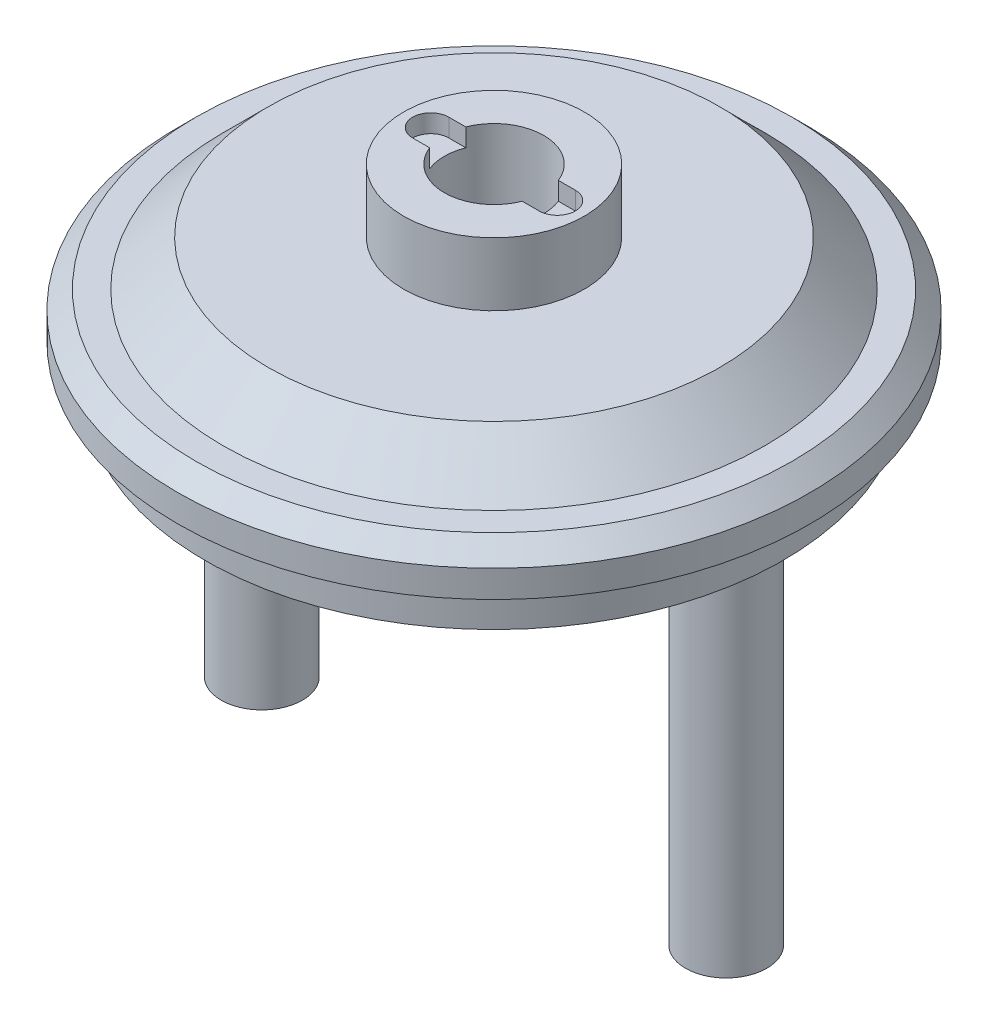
ISO-10303-21;
HEADER;
FILE_DESCRIPTION(('STEP AP214'),'2;1');
FILE_NAME('part.step','',(''),(''),'','','');
FILE_SCHEMA(('AUTOMOTIVE_DESIGN { 1 0 10303 214 1 1 1 1 }'));
ENDSEC;
DATA;
#1=APPLICATION_CONTEXT('core data for automotive mechanical design processes');
#2=APPLICATION_PROTOCOL_DEFINITION('international standard','automotive_design',2000,#1);
#3=PRODUCT_CONTEXT('',#1,'mechanical');
#4=PRODUCT('Part','Part','',(#3));
#5=PRODUCT_RELATED_PRODUCT_CATEGORY('part','',(#4));
#6=PRODUCT_DEFINITION_FORMATION('','',#4);
#7=PRODUCT_DEFINITION_CONTEXT('part definition',#1,'design');
#8=PRODUCT_DEFINITION('design','',#6,#7);
#9=PRODUCT_DEFINITION_SHAPE('','',#8);
#10=(LENGTH_UNIT() NAMED_UNIT(*) SI_UNIT(.MILLI.,.METRE.));
#11=(NAMED_UNIT(*) PLANE_ANGLE_UNIT() SI_UNIT($,.RADIAN.));
#12=(NAMED_UNIT(*) SI_UNIT($,.STERADIAN.) SOLID_ANGLE_UNIT());
#13=UNCERTAINTY_MEASURE_WITH_UNIT(LENGTH_MEASURE(1.E-05),#10,'distance_accuracy_value','');
#14=(GEOMETRIC_REPRESENTATION_CONTEXT(3) GLOBAL_UNCERTAINTY_ASSIGNED_CONTEXT((#13)) GLOBAL_UNIT_ASSIGNED_CONTEXT((#10,
#11,#12)) REPRESENTATION_CONTEXT('',''));
#15=CARTESIAN_POINT('',(0.,0.,0.));
#16=DIRECTION('',(0.,0.,1.));
#17=DIRECTION('',(1.,0.,0.));
#18=AXIS2_PLACEMENT_3D('',#15,#16,#17);
#19=CARTESIAN_POINT('',(0.,15.,0.));
#20=DIRECTION('',(0.,1.,0.));
#21=DIRECTION('',(0.,0.,1.));
#22=AXIS2_PLACEMENT_3D('',#19,#20,#21);
#23=PLANE('',#22);
#24=CARTESIAN_POINT('',(0.,15.,0.));
#25=DIRECTION('',(0.,1.,0.));
#26=DIRECTION('',(0.,0.,1.));
#27=AXIS2_PLACEMENT_3D('',#24,#25,#26);
#28=CIRCLE('',#27,25.);
#29=CARTESIAN_POINT('',(0.,15.,25.));
#30=VERTEX_POINT('',#29);
#31=EDGE_CURVE('E191',#30,#30,#28,.T.);
#32=ORIENTED_EDGE('',*,*,#31,.T.);
#33=EDGE_LOOP('',(#32));
#34=FACE_BOUND('',#33,.T.);
#35=CARTESIAN_POINT('',(0.,15.,0.));
#36=DIRECTION('',(0.,1.,0.));
#37=DIRECTION('',(0.,0.,1.));
#38=AXIS2_PLACEMENT_3D('',#35,#36,#37);
#39=CIRCLE('',#38,10.);
#40=CARTESIAN_POINT('',(0.,15.,10.));
#41=VERTEX_POINT('',#40);
#42=EDGE_CURVE('E148',#41,#41,#39,.T.);
#43=ORIENTED_EDGE('',*,*,#42,.F.);
#44=EDGE_LOOP('',(#43));
#45=FACE_BOUND('',#44,.T.);
#46=ADVANCED_FACE('F33',(#34,#45),#23,.T.);
#47=CARTESIAN_POINT('',(0.,15.,0.));
#48=DIRECTION('',(0.,-1.,0.));
#49=DIRECTION('',(0.,0.,-1.));
#50=AXIS2_PLACEMENT_3D('',#47,#48,#49);
#51=CYLINDRICAL_SURFACE('',#50,35.);
#52=CARTESIAN_POINT('',(0.,8.00000000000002,0.));
#53=DIRECTION('',(0.,1.,0.));
#54=DIRECTION('',(0.,0.,1.));
#55=AXIS2_PLACEMENT_3D('',#52,#53,#54);
#56=CIRCLE('',#55,35.);
#57=CARTESIAN_POINT('',(0.,8.00000000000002,35.));
#58=VERTEX_POINT('',#57);
#59=EDGE_CURVE('E11',#58,#58,#56,.F.);
#60=ORIENTED_EDGE('',*,*,#59,.T.);
#61=EDGE_LOOP('',(#60));
#62=FACE_BOUND('',#61,.T.);
#63=CARTESIAN_POINT('',(0.,5.,0.));
#64=DIRECTION('',(0.,-1.,0.));
#65=DIRECTION('',(0.,0.,-1.));
#66=AXIS2_PLACEMENT_3D('',#63,#64,#65);
#67=CIRCLE('',#66,35.);
#68=CARTESIAN_POINT('',(0.,5.,-35.));
#69=VERTEX_POINT('',#68);
#70=EDGE_CURVE('E167',#69,#69,#67,.T.);
#71=ORIENTED_EDGE('',*,*,#70,.F.);
#72=EDGE_LOOP('',(#71));
#73=FACE_BOUND('',#72,.T.);
#74=ADVANCED_FACE('F208',(#62,#73),#51,.T.);
#75=CARTESIAN_POINT('',(0.,0.,0.));
#76=DIRECTION('',(0.,1.,0.));
#77=DIRECTION('',(0.,0.,1.));
#78=AXIS2_PLACEMENT_3D('',#75,#76,#77);
#79=PLANE('',#78);
#80=CARTESIAN_POINT('',(0.,0.,0.));
#81=DIRECTION('',(0.,1.,0.));
#82=DIRECTION('',(0.,0.,1.));
#83=AXIS2_PLACEMENT_3D('',#80,#81,#82);
#84=CIRCLE('',#83,5.5);
#85=CARTESIAN_POINT('',(0.,0.,5.5));
#86=VERTEX_POINT('',#85);
#87=EDGE_CURVE('E145',#86,#86,#84,.T.);
#88=ORIENTED_EDGE('',*,*,#87,.T.);
#89=EDGE_LOOP('',(#88));
#90=FACE_BOUND('',#89,.T.);
#91=CARTESIAN_POINT('',(-25.7,0.,0.));
#92=DIRECTION('',(0.,1.,0.));
#93=DIRECTION('',(0.,0.,1.));
#94=AXIS2_PLACEMENT_3D('',#91,#92,#93);
#95=CIRCLE('',#94,4.5);
#96=CARTESIAN_POINT('',(-25.7,0.,4.5));
#97=VERTEX_POINT('',#96);
#98=EDGE_CURVE('E172',#97,#97,#95,.F.);
#99=ORIENTED_EDGE('',*,*,#98,.F.);
#100=EDGE_LOOP('',(#99));
#101=FACE_BOUND('',#100,.T.);
#102=CARTESIAN_POINT('',(0.,0.,0.));
#103=DIRECTION('',(0.,-1.,0.));
#104=DIRECTION('',(0.,0.,-1.));
#105=AXIS2_PLACEMENT_3D('',#102,#103,#104);
#106=CIRCLE('',#105,32.);
#107=CARTESIAN_POINT('',(0.,0.,-32.));
#108=VERTEX_POINT('',#107);
#109=EDGE_CURVE('E163',#108,#108,#106,.T.);
#110=ORIENTED_EDGE('',*,*,#109,.T.);
#111=EDGE_LOOP('',(#110));
#112=FACE_BOUND('',#111,.T.);
#113=CARTESIAN_POINT('',(25.7,0.,0.));
#114=DIRECTION('',(0.,1.,0.));
#115=DIRECTION('',(0.,0.,1.));
#116=AXIS2_PLACEMENT_3D('',#113,#114,#115);
#117=CIRCLE('',#116,4.5);
#118=CARTESIAN_POINT('',(25.7,0.,4.5));
#119=VERTEX_POINT('',#118);
#120=EDGE_CURVE('E175',#119,#119,#117,.F.);
#121=ORIENTED_EDGE('',*,*,#120,.F.);
#122=EDGE_LOOP('',(#121));
#123=FACE_BOUND('',#122,.T.);
#124=ADVANCED_FACE('F214',(#90,#101,#112,#123),#79,.F.);
#125=CARTESIAN_POINT('',(0.,5.,0.));
#126=DIRECTION('',(0.,-1.,0.));
#127=DIRECTION('',(0.,0.,-1.));
#128=AXIS2_PLACEMENT_3D('',#125,#126,#127);
#129=PLANE('',#128);
#130=CARTESIAN_POINT('',(0.,5.,0.));
#131=DIRECTION('',(0.,-1.,0.));
#132=DIRECTION('',(0.,0.,-1.));
#133=AXIS2_PLACEMENT_3D('',#130,#131,#132);
#134=CIRCLE('',#133,32.);
#135=CARTESIAN_POINT('',(0.,5.,-32.));
#136=VERTEX_POINT('',#135);
#137=EDGE_CURVE('E164',#136,#136,#134,.T.);
#138=ORIENTED_EDGE('',*,*,#137,.F.);
#139=EDGE_LOOP('',(#138));
#140=FACE_BOUND('',#139,.T.);
#141=ORIENTED_EDGE('',*,*,#70,.T.);
#142=EDGE_LOOP('',(#141));
#143=FACE_BOUND('',#142,.T.);
#144=ADVANCED_FACE('F220',(#140,#143),#129,.T.);
#145=CARTESIAN_POINT('',(0.,5.,0.));
#146=DIRECTION('',(0.,-1.,0.));
#147=DIRECTION('',(0.,0.,-1.));
#148=AXIS2_PLACEMENT_3D('',#145,#146,#147);
#149=CYLINDRICAL_SURFACE('',#148,32.);
#150=ORIENTED_EDGE('',*,*,#137,.T.);
#151=EDGE_LOOP('',(#150));
#152=FACE_BOUND('',#151,.T.);
#153=ORIENTED_EDGE('',*,*,#109,.F.);
#154=EDGE_LOOP('',(#153));
#155=FACE_BOUND('',#154,.T.);
#156=ADVANCED_FACE('F227',(#152,#155),#149,.T.);
#157=CARTESIAN_POINT('',(-25.7,-40.,0.));
#158=DIRECTION('',(0.,1.,0.));
#159=DIRECTION('',(0.,0.,1.));
#160=AXIS2_PLACEMENT_3D('',#157,#158,#159);
#161=CYLINDRICAL_SURFACE('',#160,4.5);
#162=CARTESIAN_POINT('',(-25.7,-40.,0.));
#163=DIRECTION('',(0.,-1.,0.));
#164=DIRECTION('',(0.,0.,-1.));
#165=AXIS2_PLACEMENT_3D('',#162,#163,#164);
#166=CIRCLE('',#165,4.5);
#167=CARTESIAN_POINT('',(-25.7,-40.,-4.5));
#168=VERTEX_POINT('',#167);
#169=EDGE_CURVE('E160',#168,#168,#166,.T.);
#170=ORIENTED_EDGE('',*,*,#169,.F.);
#171=EDGE_LOOP('',(#170));
#172=FACE_BOUND('',#171,.T.);
#173=ORIENTED_EDGE('',*,*,#98,.T.);
#174=EDGE_LOOP('',(#173));
#175=FACE_BOUND('',#174,.T.);
#176=ADVANCED_FACE('F249',(#172,#175),#161,.T.);
#177=CARTESIAN_POINT('',(-25.7,-40.,0.));
#178=DIRECTION('',(0.,-1.,0.));
#179=DIRECTION('',(0.,0.,-1.));
#180=AXIS2_PLACEMENT_3D('',#177,#178,#179);
#181=PLANE('',#180);
#182=ORIENTED_EDGE('',*,*,#169,.T.);
#183=EDGE_LOOP('',(#182));
#184=FACE_BOUND('',#183,.T.);
#185=ADVANCED_FACE('F240',(#184),#181,.T.);
#186=CARTESIAN_POINT('',(25.7,-40.,0.));
#187=DIRECTION('',(0.,1.,0.));
#188=DIRECTION('',(0.,0.,1.));
#189=AXIS2_PLACEMENT_3D('',#186,#187,#188);
#190=CYLINDRICAL_SURFACE('',#189,4.5);
#191=CARTESIAN_POINT('',(25.7,-40.,0.));
#192=DIRECTION('',(0.,-1.,0.));
#193=DIRECTION('',(0.,0.,-1.));
#194=AXIS2_PLACEMENT_3D('',#191,#192,#193);
#195=CIRCLE('',#194,4.5);
#196=CARTESIAN_POINT('',(25.7,-40.,-4.5));
#197=VERTEX_POINT('',#196);
#198=EDGE_CURVE('E157',#197,#197,#195,.T.);
#199=ORIENTED_EDGE('',*,*,#198,.F.);
#200=EDGE_LOOP('',(#199));
#201=FACE_BOUND('',#200,.T.);
#202=ORIENTED_EDGE('',*,*,#120,.T.);
#203=EDGE_LOOP('',(#202));
#204=FACE_BOUND('',#203,.T.);
#205=ADVANCED_FACE('F237',(#201,#204),#190,.T.);
#206=CARTESIAN_POINT('',(25.7,-40.,0.));
#207=DIRECTION('',(0.,-1.,0.));
#208=DIRECTION('',(0.,0.,-1.));
#209=AXIS2_PLACEMENT_3D('',#206,#207,#208);
#210=PLANE('',#209);
#211=ORIENTED_EDGE('',*,*,#198,.T.);
#212=EDGE_LOOP('',(#211));
#213=FACE_BOUND('',#212,.T.);
#214=ADVANCED_FACE('F239',(#213),#210,.T.);
#215=CARTESIAN_POINT('',(0.,10.,0.));
#216=DIRECTION('',(0.,1.,0.));
#217=DIRECTION('',(0.,0.,1.));
#218=AXIS2_PLACEMENT_3D('',#215,#216,#217);
#219=PLANE('',#218);
#220=CARTESIAN_POINT('',(0.,10.,0.));
#221=DIRECTION('',(0.,1.,0.));
#222=DIRECTION('',(0.,0.,1.));
#223=AXIS2_PLACEMENT_3D('',#220,#221,#222);
#224=CIRCLE('',#223,33.);
#225=CARTESIAN_POINT('',(0.,10.,33.));
#226=VERTEX_POINT('',#225);
#227=EDGE_CURVE('E41',#226,#226,#224,.T.);
#228=ORIENTED_EDGE('',*,*,#227,.T.);
#229=EDGE_LOOP('',(#228));
#230=FACE_BOUND('',#229,.T.);
#231=CARTESIAN_POINT('',(0.,10.,0.));
#232=DIRECTION('',(0.,1.,0.));
#233=DIRECTION('',(0.,0.,1.));
#234=AXIS2_PLACEMENT_3D('',#231,#232,#233);
#235=CIRCLE('',#234,30.);
#236=CARTESIAN_POINT('',(0.,10.,30.));
#237=VERTEX_POINT('',#236);
#238=EDGE_CURVE('E152',#237,#237,#235,.T.);
#239=ORIENTED_EDGE('',*,*,#238,.F.);
#240=EDGE_LOOP('',(#239));
#241=FACE_BOUND('',#240,.T.);
#242=ADVANCED_FACE('F196',(#230,#241),#219,.T.);
#243=CARTESIAN_POINT('',(0.,22.,0.));
#244=DIRECTION('',(0.,-1.,0.));
#245=DIRECTION('',(0.,0.,-1.));
#246=AXIS2_PLACEMENT_3D('',#243,#244,#245);
#247=CYLINDRICAL_SURFACE('',#246,10.);
#248=CARTESIAN_POINT('',(0.,22.,0.));
#249=DIRECTION('',(0.,1.,0.));
#250=DIRECTION('',(0.,0.,1.));
#251=AXIS2_PLACEMENT_3D('',#248,#249,#250);
#252=CIRCLE('',#251,10.);
#253=CARTESIAN_POINT('',(0.,22.,10.));
#254=VERTEX_POINT('',#253);
#255=EDGE_CURVE('E149',#254,#254,#252,.T.);
#256=ORIENTED_EDGE('',*,*,#255,.F.);
#257=EDGE_LOOP('',(#256));
#258=FACE_BOUND('',#257,.T.);
#259=ORIENTED_EDGE('',*,*,#42,.T.);
#260=EDGE_LOOP('',(#259));
#261=FACE_BOUND('',#260,.T.);
#262=ADVANCED_FACE('F293',(#258,#261),#247,.T.);
#263=CARTESIAN_POINT('',(0.,22.,0.));
#264=DIRECTION('',(0.,1.,0.));
#265=DIRECTION('',(0.,0.,1.));
#266=AXIS2_PLACEMENT_3D('',#263,#264,#265);
#267=PLANE('',#266);
#268=DIRECTION('',(-1.,0.,0.));
#269=VECTOR('',#268,1.);
#270=CARTESIAN_POINT('',(-7.,22.,-2.));
#271=LINE('',#270,#269);
#272=CARTESIAN_POINT('',(-5.1234753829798,22.,-2.));
#273=VERTEX_POINT('',#272);
#274=CARTESIAN_POINT('',(-7.,22.,-2.));
#275=VERTEX_POINT('',#274);
#276=EDGE_CURVE('E123',#273,#275,#271,.T.);
#277=ORIENTED_EDGE('',*,*,#276,.F.);
#278=CARTESIAN_POINT('',(0.,22.,0.));
#279=DIRECTION('',(0.,1.,0.));
#280=DIRECTION('',(0.,0.,1.));
#281=AXIS2_PLACEMENT_3D('',#278,#279,#280);
#282=CIRCLE('',#281,5.5);
#283=CARTESIAN_POINT('',(5.1234753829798,22.,-2.));
#284=VERTEX_POINT('',#283);
#285=EDGE_CURVE('E144',#284,#273,#282,.T.);
#286=ORIENTED_EDGE('',*,*,#285,.F.);
#287=CARTESIAN_POINT('',(7.,22.,-2.));
#288=VERTEX_POINT('',#287);
#289=EDGE_CURVE('E121',#288,#284,#271,.T.);
#290=ORIENTED_EDGE('',*,*,#289,.F.);
#291=CARTESIAN_POINT('',(7.,22.,0.));
#292=DIRECTION('',(0.,1.,0.));
#293=DIRECTION('',(0.,0.,1.));
#294=AXIS2_PLACEMENT_3D('',#291,#292,#293);
#295=CIRCLE('',#294,2.);
#296=CARTESIAN_POINT('',(7.,22.,2.));
#297=VERTEX_POINT('',#296);
#298=EDGE_CURVE('E132',#297,#288,#295,.T.);
#299=ORIENTED_EDGE('',*,*,#298,.F.);
#300=DIRECTION('',(1.,0.,0.));
#301=VECTOR('',#300,1.);
#302=CARTESIAN_POINT('',(-7.,22.,2.));
#303=LINE('',#302,#301);
#304=CARTESIAN_POINT('',(5.1234753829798,22.,2.));
#305=VERTEX_POINT('',#304);
#306=EDGE_CURVE('E129',#305,#297,#303,.T.);
#307=ORIENTED_EDGE('',*,*,#306,.F.);
#308=CARTESIAN_POINT('',(-5.1234753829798,22.,2.));
#309=VERTEX_POINT('',#308);
#310=EDGE_CURVE('E137',#309,#305,#282,.T.);
#311=ORIENTED_EDGE('',*,*,#310,.F.);
#312=CARTESIAN_POINT('',(-7.,22.,2.));
#313=VERTEX_POINT('',#312);
#314=EDGE_CURVE('E130',#313,#309,#303,.T.);
#315=ORIENTED_EDGE('',*,*,#314,.F.);
#316=CARTESIAN_POINT('',(-7.,22.,0.));
#317=DIRECTION('',(0.,1.,0.));
#318=DIRECTION('',(0.,0.,1.));
#319=AXIS2_PLACEMENT_3D('',#316,#317,#318);
#320=CIRCLE('',#319,2.);
#321=EDGE_CURVE('E105',#275,#313,#320,.T.);
#322=ORIENTED_EDGE('',*,*,#321,.F.);
#323=EDGE_LOOP('',(#277,#286,#290,#299,#307,#311,#315,#322));
#324=FACE_BOUND('',#323,.T.);
#325=ORIENTED_EDGE('',*,*,#255,.T.);
#326=EDGE_LOOP('',(#325));
#327=FACE_BOUND('',#326,.T.);
#328=ADVANCED_FACE('F297',(#324,#327),#267,.T.);
#329=CARTESIAN_POINT('',(0.,-8.,0.));
#330=DIRECTION('',(0.,1.,0.));
#331=DIRECTION('',(0.,0.,1.));
#332=AXIS2_PLACEMENT_3D('',#329,#330,#331);
#333=CYLINDRICAL_SURFACE('',#332,5.5);
#334=ORIENTED_EDGE('',*,*,#285,.T.);
#335=DIRECTION('',(0.,1.,0.));
#336=VECTOR('',#335,1.);
#337=CARTESIAN_POINT('',(-5.1234753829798,-8.,-2.));
#338=LINE('',#337,#336);
#339=CARTESIAN_POINT('',(-5.1234753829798,20.,-2.));
#340=VERTEX_POINT('',#339);
#341=EDGE_CURVE('E188',#273,#340,#338,.F.);
#342=ORIENTED_EDGE('',*,*,#341,.T.);
#343=CARTESIAN_POINT('',(0.,20.,0.));
#344=DIRECTION('',(0.,1.,0.));
#345=DIRECTION('',(0.,0.,1.));
#346=AXIS2_PLACEMENT_3D('',#343,#344,#345);
#347=CIRCLE('',#346,5.5);
#348=CARTESIAN_POINT('',(-5.1234753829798,20.,2.));
#349=VERTEX_POINT('',#348);
#350=EDGE_CURVE('E181',#349,#340,#347,.F.);
#351=ORIENTED_EDGE('',*,*,#350,.F.);
#352=DIRECTION('',(0.,1.,0.));
#353=VECTOR('',#352,1.);
#354=CARTESIAN_POINT('',(-5.1234753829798,-8.,2.));
#355=LINE('',#354,#353);
#356=EDGE_CURVE('E112',#349,#309,#355,.T.);
#357=ORIENTED_EDGE('',*,*,#356,.T.);
#358=ORIENTED_EDGE('',*,*,#310,.T.);
#359=DIRECTION('',(0.,1.,0.));
#360=VECTOR('',#359,1.);
#361=CARTESIAN_POINT('',(5.1234753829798,-8.,2.));
#362=LINE('',#361,#360);
#363=CARTESIAN_POINT('',(5.1234753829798,20.,2.));
#364=VERTEX_POINT('',#363);
#365=EDGE_CURVE('E180',#305,#364,#362,.F.);
#366=ORIENTED_EDGE('',*,*,#365,.T.);
#367=CARTESIAN_POINT('',(5.1234753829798,20.,-2.));
#368=VERTEX_POINT('',#367);
#369=EDGE_CURVE('E178',#368,#364,#347,.F.);
#370=ORIENTED_EDGE('',*,*,#369,.F.);
#371=DIRECTION('',(0.,1.,0.));
#372=VECTOR('',#371,1.);
#373=CARTESIAN_POINT('',(5.1234753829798,-8.,-2.));
#374=LINE('',#373,#372);
#375=EDGE_CURVE('E184',#368,#284,#374,.T.);
#376=ORIENTED_EDGE('',*,*,#375,.T.);
#377=EDGE_LOOP('',(#334,#342,#351,#357,#358,#366,#370,#376));
#378=FACE_BOUND('',#377,.T.);
#379=ORIENTED_EDGE('',*,*,#87,.F.);
#380=EDGE_LOOP('',(#379));
#381=FACE_BOUND('',#380,.T.);
#382=ADVANCED_FACE('F313',(#378,#381),#333,.F.);
#383=CARTESIAN_POINT('',(-7.,20.,0.));
#384=DIRECTION('',(0.,1.,0.));
#385=DIRECTION('',(0.,0.,1.));
#386=AXIS2_PLACEMENT_3D('',#383,#384,#385);
#387=PLANE('',#386);
#388=ORIENTED_EDGE('',*,*,#369,.T.);
#389=DIRECTION('',(1.,0.,0.));
#390=VECTOR('',#389,1.);
#391=CARTESIAN_POINT('',(-7.,20.,2.));
#392=LINE('',#391,#390);
#393=CARTESIAN_POINT('',(7.,20.,2.));
#394=VERTEX_POINT('',#393);
#395=EDGE_CURVE('E115',#364,#394,#392,.T.);
#396=ORIENTED_EDGE('',*,*,#395,.T.);
#397=CARTESIAN_POINT('',(7.,20.,0.));
#398=DIRECTION('',(0.,1.,0.));
#399=DIRECTION('',(0.,0.,1.));
#400=AXIS2_PLACEMENT_3D('',#397,#398,#399);
#401=CIRCLE('',#400,2.);
#402=CARTESIAN_POINT('',(7.,20.,-2.));
#403=VERTEX_POINT('',#402);
#404=EDGE_CURVE('E114',#394,#403,#401,.T.);
#405=ORIENTED_EDGE('',*,*,#404,.T.);
#406=DIRECTION('',(-1.,0.,0.));
#407=VECTOR('',#406,1.);
#408=CARTESIAN_POINT('',(-7.,20.,-2.));
#409=LINE('',#408,#407);
#410=EDGE_CURVE('E56',#403,#368,#409,.T.);
#411=ORIENTED_EDGE('',*,*,#410,.T.);
#412=EDGE_LOOP('',(#388,#396,#405,#411));
#413=FACE_BOUND('',#412,.T.);
#414=ADVANCED_FACE('F323',(#413),#387,.T.);
#415=CARTESIAN_POINT('',(-7.,20.,2.));
#416=DIRECTION('',(0.,0.,1.));
#417=DIRECTION('',(1.,0.,0.));
#418=AXIS2_PLACEMENT_3D('',#415,#416,#417);
#419=PLANE('',#418);
#420=ORIENTED_EDGE('',*,*,#306,.T.);
#421=DIRECTION('',(0.,1.,0.));
#422=VECTOR('',#421,1.);
#423=CARTESIAN_POINT('',(7.,20.,2.));
#424=LINE('',#423,#422);
#425=EDGE_CURVE('E108',#394,#297,#424,.T.);
#426=ORIENTED_EDGE('',*,*,#425,.F.);
#427=ORIENTED_EDGE('',*,*,#395,.F.);
#428=ORIENTED_EDGE('',*,*,#365,.F.);
#429=EDGE_LOOP('',(#420,#426,#427,#428));
#430=FACE_BOUND('',#429,.T.);
#431=ADVANCED_FACE('F333',(#430),#419,.F.);
#432=CARTESIAN_POINT('',(-7.,20.,-2.));
#433=DIRECTION('',(0.,0.,-1.));
#434=DIRECTION('',(-1.,0.,0.));
#435=AXIS2_PLACEMENT_3D('',#432,#433,#434);
#436=PLANE('',#435);
#437=ORIENTED_EDGE('',*,*,#410,.F.);
#438=DIRECTION('',(0.,1.,0.));
#439=VECTOR('',#438,1.);
#440=CARTESIAN_POINT('',(7.,20.,-2.));
#441=LINE('',#440,#439);
#442=EDGE_CURVE('E138',#403,#288,#441,.T.);
#443=ORIENTED_EDGE('',*,*,#442,.T.);
#444=ORIENTED_EDGE('',*,*,#289,.T.);
#445=ORIENTED_EDGE('',*,*,#375,.F.);
#446=EDGE_LOOP('',(#437,#443,#444,#445));
#447=FACE_BOUND('',#446,.T.);
#448=ADVANCED_FACE('F342',(#447),#436,.F.);
#449=CARTESIAN_POINT('',(7.,20.,0.));
#450=DIRECTION('',(0.,1.,0.));
#451=DIRECTION('',(0.,0.,1.));
#452=AXIS2_PLACEMENT_3D('',#449,#450,#451);
#453=CYLINDRICAL_SURFACE('',#452,2.);
#454=ORIENTED_EDGE('',*,*,#298,.T.);
#455=ORIENTED_EDGE('',*,*,#442,.F.);
#456=ORIENTED_EDGE('',*,*,#404,.F.);
#457=ORIENTED_EDGE('',*,*,#425,.T.);
#458=EDGE_LOOP('',(#454,#455,#456,#457));
#459=FACE_BOUND('',#458,.T.);
#460=ADVANCED_FACE('F352',(#459),#453,.F.);
#461=ORIENTED_EDGE('',*,*,#276,.T.);
#462=DIRECTION('',(0.,1.,0.));
#463=VECTOR('',#462,1.);
#464=CARTESIAN_POINT('',(-7.,20.,-2.));
#465=LINE('',#464,#463);
#466=CARTESIAN_POINT('',(-7.,20.,-2.));
#467=VERTEX_POINT('',#466);
#468=EDGE_CURVE('E135',#467,#275,#465,.T.);
#469=ORIENTED_EDGE('',*,*,#468,.F.);
#470=EDGE_CURVE('E119',#340,#467,#409,.T.);
#471=ORIENTED_EDGE('',*,*,#470,.F.);
#472=ORIENTED_EDGE('',*,*,#341,.F.);
#473=EDGE_LOOP('',(#461,#469,#471,#472));
#474=FACE_BOUND('',#473,.T.);
#475=ADVANCED_FACE('F355',(#474),#436,.F.);
#476=CARTESIAN_POINT('',(-7.,20.,2.));
#477=VERTEX_POINT('',#476);
#478=EDGE_CURVE('E48',#477,#349,#392,.T.);
#479=ORIENTED_EDGE('',*,*,#478,.F.);
#480=DIRECTION('',(0.,1.,0.));
#481=VECTOR('',#480,1.);
#482=CARTESIAN_POINT('',(-7.,20.,2.));
#483=LINE('',#482,#481);
#484=EDGE_CURVE('E100',#477,#313,#483,.T.);
#485=ORIENTED_EDGE('',*,*,#484,.T.);
#486=ORIENTED_EDGE('',*,*,#314,.T.);
#487=ORIENTED_EDGE('',*,*,#356,.F.);
#488=EDGE_LOOP('',(#479,#485,#486,#487));
#489=FACE_BOUND('',#488,.T.);
#490=ADVANCED_FACE('F110',(#489),#419,.F.);
#491=ORIENTED_EDGE('',*,*,#350,.T.);
#492=ORIENTED_EDGE('',*,*,#470,.T.);
#493=CARTESIAN_POINT('',(-7.,20.,0.));
#494=DIRECTION('',(0.,1.,0.));
#495=DIRECTION('',(0.,0.,1.));
#496=AXIS2_PLACEMENT_3D('',#493,#494,#495);
#497=CIRCLE('',#496,2.);
#498=EDGE_CURVE('E103',#467,#477,#497,.T.);
#499=ORIENTED_EDGE('',*,*,#498,.T.);
#500=ORIENTED_EDGE('',*,*,#478,.T.);
#501=EDGE_LOOP('',(#491,#492,#499,#500));
#502=FACE_BOUND('',#501,.T.);
#503=ADVANCED_FACE('F117',(#502),#387,.T.);
#504=CARTESIAN_POINT('',(-7.,20.,0.));
#505=DIRECTION('',(0.,1.,0.));
#506=DIRECTION('',(0.,0.,1.));
#507=AXIS2_PLACEMENT_3D('',#504,#505,#506);
#508=CYLINDRICAL_SURFACE('',#507,2.);
#509=ORIENTED_EDGE('',*,*,#321,.T.);
#510=ORIENTED_EDGE('',*,*,#484,.F.);
#511=ORIENTED_EDGE('',*,*,#498,.F.);
#512=ORIENTED_EDGE('',*,*,#468,.T.);
#513=EDGE_LOOP('',(#509,#510,#511,#512));
#514=FACE_BOUND('',#513,.T.);
#515=ADVANCED_FACE('F101',(#514),#508,.F.);
#516=CARTESIAN_POINT('',(0.,15.,0.));
#517=DIRECTION('',(0.,-1.,0.));
#518=DIRECTION('',(0.,0.,-1.));
#519=AXIS2_PLACEMENT_3D('',#516,#517,#518);
#520=CONICAL_SURFACE('',#519,25.,0.785398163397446);
#521=ORIENTED_EDGE('',*,*,#238,.T.);
#522=EDGE_LOOP('',(#521));
#523=FACE_BOUND('',#522,.T.);
#524=ORIENTED_EDGE('',*,*,#31,.F.);
#525=EDGE_LOOP('',(#524));
#526=FACE_BOUND('',#525,.T.);
#527=ADVANCED_FACE('F200',(#523,#526),#520,.T.);
#528=CARTESIAN_POINT('',(0.,10.,0.));
#529=DIRECTION('',(0.,-1.,0.));
#530=DIRECTION('',(0.,0.,-1.));
#531=AXIS2_PLACEMENT_3D('',#528,#529,#530);
#532=CONICAL_SURFACE('',#531,33.,0.785398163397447);
#533=ORIENTED_EDGE('',*,*,#59,.F.);
#534=EDGE_LOOP('',(#533));
#535=FACE_BOUND('',#534,.T.);
#536=ORIENTED_EDGE('',*,*,#227,.F.);
#537=EDGE_LOOP('',(#536));
#538=FACE_BOUND('',#537,.T.);
#539=ADVANCED_FACE('F35',(#535,#538),#532,.T.);
#540=CLOSED_SHELL('',(#46,#74,#124,#144,#156,#176,#185,#205,#214,#242,#262,#328,#382,#414,#431,
#448,#460,#475,#490,#503,#515,#527,#539));
#541=MANIFOLD_SOLID_BREP('B2',#540);
#542=ADVANCED_BREP_SHAPE_REPRESENTATION('',(#18,#541),#14);
#543=SHAPE_DEFINITION_REPRESENTATION(#9,#542);
ENDSEC;
END-ISO-10303-21;
